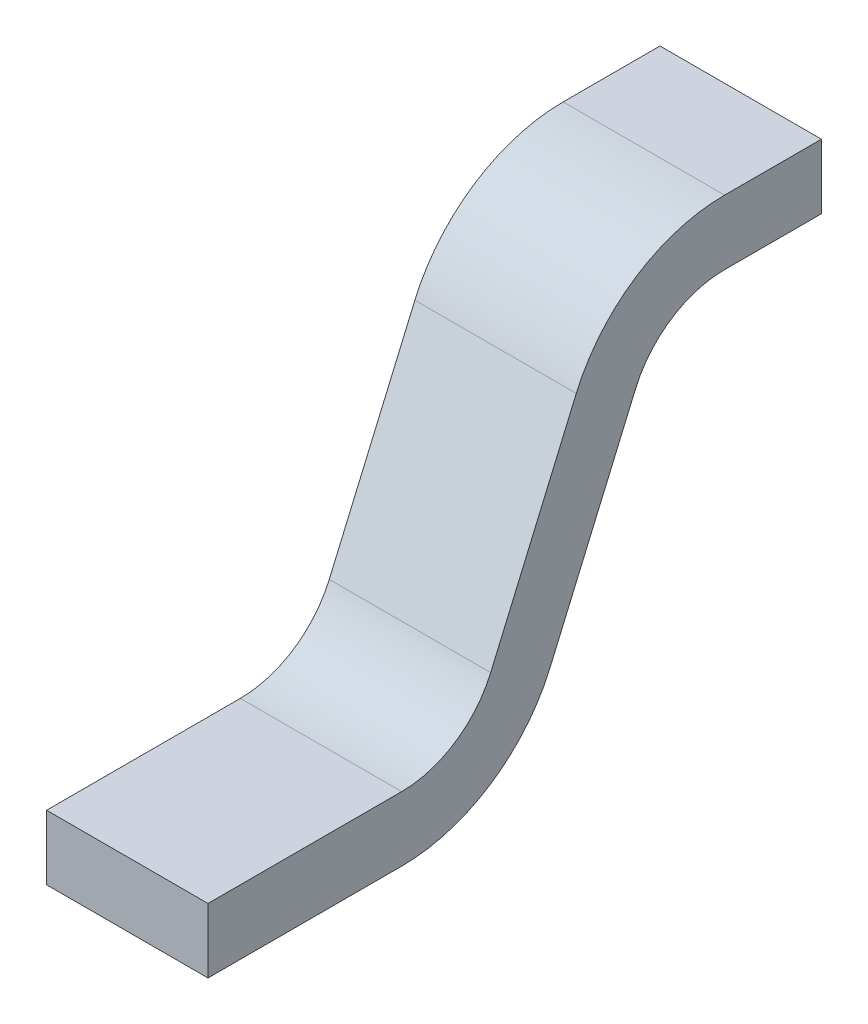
ISO-10303-21;
HEADER;
FILE_DESCRIPTION(('STEP AP214'),'2;1');
FILE_NAME('part.step','',(''),(''),'','','');
FILE_SCHEMA(('AUTOMOTIVE_DESIGN { 1 0 10303 214 1 1 1 1 }'));
ENDSEC;
DATA;
#1=APPLICATION_CONTEXT('core data for automotive mechanical design processes');
#2=APPLICATION_PROTOCOL_DEFINITION('international standard','automotive_design',2000,#1);
#3=PRODUCT_CONTEXT('',#1,'mechanical');
#4=PRODUCT('Part','Part','',(#3));
#5=PRODUCT_RELATED_PRODUCT_CATEGORY('part','',(#4));
#6=PRODUCT_DEFINITION_FORMATION('','',#4);
#7=PRODUCT_DEFINITION_CONTEXT('part definition',#1,'design');
#8=PRODUCT_DEFINITION('design','',#6,#7);
#9=PRODUCT_DEFINITION_SHAPE('','',#8);
#10=(LENGTH_UNIT() NAMED_UNIT(*) SI_UNIT(.MILLI.,.METRE.));
#11=(NAMED_UNIT(*) PLANE_ANGLE_UNIT() SI_UNIT($,.RADIAN.));
#12=(NAMED_UNIT(*) SI_UNIT($,.STERADIAN.) SOLID_ANGLE_UNIT());
#13=UNCERTAINTY_MEASURE_WITH_UNIT(LENGTH_MEASURE(1.E-05),#10,'distance_accuracy_value','');
#14=(GEOMETRIC_REPRESENTATION_CONTEXT(3) GLOBAL_UNCERTAINTY_ASSIGNED_CONTEXT((#13)) GLOBAL_UNIT_ASSIGNED_CONTEXT((#10,
#11,#12)) REPRESENTATION_CONTEXT('',''));
#15=CARTESIAN_POINT('',(0.,0.,0.));
#16=DIRECTION('',(0.,0.,1.));
#17=DIRECTION('',(1.,0.,0.));
#18=AXIS2_PLACEMENT_3D('',#15,#16,#17);
#19=CARTESIAN_POINT('',(0.125,-0.2,0.15));
#20=DIRECTION('',(1.,0.,0.));
#21=DIRECTION('',(0.,0.,-1.));
#22=AXIS2_PLACEMENT_3D('',#19,#20,#21);
#23=PLANE('',#22);
#24=DIRECTION('',(0.,0.918574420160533,-0.395248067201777));
#25=VECTOR('',#24,1.);
#26=CARTESIAN_POINT('',(0.125,-0.140712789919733,0.28778616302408));
#27=LINE('',#26,#25);
#28=CARTESIAN_POINT('',(0.125,-0.140712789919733,0.28778616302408));
#29=VERTEX_POINT('',#28);
#30=CARTESIAN_POINT('',(0.125,-0.448812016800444,0.420356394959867));
#31=VERTEX_POINT('',#30);
#32=EDGE_CURVE('E125',#29,#31,#27,.F.);
#33=ORIENTED_EDGE('',*,*,#32,.F.);
#34=CARTESIAN_POINT('',(0.125,-0.2,0.15));
#35=DIRECTION('',(1.,0.,0.));
#36=DIRECTION('',(0.,0.,-1.));
#37=AXIS2_PLACEMENT_3D('',#34,#35,#36);
#38=CIRCLE('',#37,0.15);
#39=CARTESIAN_POINT('',(0.125,-0.05,0.15));
#40=VERTEX_POINT('',#39);
#41=EDGE_CURVE('E111',#29,#40,#38,.F.);
#42=ORIENTED_EDGE('',*,*,#41,.T.);
#43=DIRECTION('',(0.,0.,-1.));
#44=VECTOR('',#43,1.);
#45=CARTESIAN_POINT('',(0.125,-0.05,0.15));
#46=LINE('',#45,#44);
#47=CARTESIAN_POINT('',(0.125,-0.05,0.));
#48=VERTEX_POINT('',#47);
#49=EDGE_CURVE('E109',#48,#40,#46,.F.);
#50=ORIENTED_EDGE('',*,*,#49,.F.);
#51=DIRECTION('',(0.,1.,0.));
#52=VECTOR('',#51,1.);
#53=CARTESIAN_POINT('',(0.125,0.05,0.));
#54=LINE('',#53,#52);
#55=CARTESIAN_POINT('',(0.125,0.05,0.));
#56=VERTEX_POINT('',#55);
#57=EDGE_CURVE('E94',#48,#56,#54,.T.);
#58=ORIENTED_EDGE('',*,*,#57,.T.);
#59=DIRECTION('',(0.,0.,-1.));
#60=VECTOR('',#59,1.);
#61=CARTESIAN_POINT('',(0.125,0.05,0.15));
#62=LINE('',#61,#60);
#63=CARTESIAN_POINT('',(0.125,0.05,0.15));
#64=VERTEX_POINT('',#63);
#65=EDGE_CURVE('E151',#56,#64,#62,.F.);
#66=ORIENTED_EDGE('',*,*,#65,.T.);
#67=CARTESIAN_POINT('',(0.125,-0.2,0.15));
#68=DIRECTION('',(1.,0.,0.));
#69=DIRECTION('',(0.,0.,-1.));
#70=AXIS2_PLACEMENT_3D('',#67,#68,#69);
#71=CIRCLE('',#70,0.25);
#72=CARTESIAN_POINT('',(0.125,-0.101187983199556,0.379643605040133));
#73=VERTEX_POINT('',#72);
#74=EDGE_CURVE('E20',#73,#64,#71,.F.);
#75=ORIENTED_EDGE('',*,*,#74,.F.);
#76=DIRECTION('',(0.,0.918574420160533,-0.395248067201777));
#77=VECTOR('',#76,1.);
#78=CARTESIAN_POINT('',(0.125,-0.101187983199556,0.379643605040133));
#79=LINE('',#78,#77);
#80=CARTESIAN_POINT('',(0.125,-0.409287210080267,0.51221383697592));
#81=VERTEX_POINT('',#80);
#82=EDGE_CURVE('E147',#73,#81,#79,.F.);
#83=ORIENTED_EDGE('',*,*,#82,.T.);
#84=CARTESIAN_POINT('',(0.125,-0.35,0.65));
#85=DIRECTION('',(1.,0.,0.));
#86=DIRECTION('',(0.,0.,-1.));
#87=AXIS2_PLACEMENT_3D('',#84,#85,#86);
#88=CIRCLE('',#87,0.15);
#89=CARTESIAN_POINT('',(0.125,-0.5,0.65));
#90=VERTEX_POINT('',#89);
#91=EDGE_CURVE('E174',#81,#90,#88,.F.);
#92=ORIENTED_EDGE('',*,*,#91,.T.);
#93=DIRECTION('',(0.,0.,-1.));
#94=VECTOR('',#93,1.);
#95=CARTESIAN_POINT('',(0.125,-0.5,0.95));
#96=LINE('',#95,#94);
#97=CARTESIAN_POINT('',(0.125,-0.5,0.95));
#98=VERTEX_POINT('',#97);
#99=EDGE_CURVE('E141',#90,#98,#96,.F.);
#100=ORIENTED_EDGE('',*,*,#99,.T.);
#101=DIRECTION('',(0.,1.,0.));
#102=VECTOR('',#101,1.);
#103=CARTESIAN_POINT('',(0.125,-0.6,0.95));
#104=LINE('',#103,#102);
#105=CARTESIAN_POINT('',(0.125,-0.6,0.95));
#106=VERTEX_POINT('',#105);
#107=EDGE_CURVE('E133',#98,#106,#104,.F.);
#108=ORIENTED_EDGE('',*,*,#107,.T.);
#109=DIRECTION('',(0.,0.,-1.));
#110=VECTOR('',#109,1.);
#111=CARTESIAN_POINT('',(0.125,-0.6,0.95));
#112=LINE('',#111,#110);
#113=CARTESIAN_POINT('',(0.125,-0.6,0.65));
#114=VERTEX_POINT('',#113);
#115=EDGE_CURVE('E129',#114,#106,#112,.F.);
#116=ORIENTED_EDGE('',*,*,#115,.F.);
#117=CARTESIAN_POINT('',(0.125,-0.35,0.65));
#118=DIRECTION('',(1.,0.,0.));
#119=DIRECTION('',(0.,0.,-1.));
#120=AXIS2_PLACEMENT_3D('',#117,#118,#119);
#121=CIRCLE('',#120,0.25);
#122=EDGE_CURVE('E173',#31,#114,#121,.F.);
#123=ORIENTED_EDGE('',*,*,#122,.F.);
#124=EDGE_LOOP('',(#33,#42,#50,#58,#66,#75,#83,#92,#100,#108,#116,#123));
#125=FACE_BOUND('',#124,.T.);
#126=ADVANCED_FACE('F17',(#125),#23,.T.);
#127=CARTESIAN_POINT('',(-0.125,0.05,0.));
#128=DIRECTION('',(0.,0.,1.));
#129=DIRECTION('',(1.,0.,0.));
#130=AXIS2_PLACEMENT_3D('',#127,#128,#129);
#131=PLANE('',#130);
#132=ORIENTED_EDGE('',*,*,#57,.F.);
#133=DIRECTION('',(1.,0.,0.));
#134=VECTOR('',#133,1.);
#135=CARTESIAN_POINT('',(-0.125,-0.05,0.));
#136=LINE('',#135,#134);
#137=CARTESIAN_POINT('',(-0.125,-0.05,0.));
#138=VERTEX_POINT('',#137);
#139=EDGE_CURVE('E104',#138,#48,#136,.T.);
#140=ORIENTED_EDGE('',*,*,#139,.F.);
#141=DIRECTION('',(0.,1.,0.));
#142=VECTOR('',#141,1.);
#143=CARTESIAN_POINT('',(-0.125,-0.2,0.));
#144=LINE('',#143,#142);
#145=CARTESIAN_POINT('',(-0.125,0.05,0.));
#146=VERTEX_POINT('',#145);
#147=EDGE_CURVE('E115',#138,#146,#144,.T.);
#148=ORIENTED_EDGE('',*,*,#147,.T.);
#149=DIRECTION('',(1.,0.,0.));
#150=VECTOR('',#149,1.);
#151=CARTESIAN_POINT('',(-0.125,0.05,0.));
#152=LINE('',#151,#150);
#153=EDGE_CURVE('E106',#146,#56,#152,.T.);
#154=ORIENTED_EDGE('',*,*,#153,.T.);
#155=EDGE_LOOP('',(#132,#140,#148,#154));
#156=FACE_BOUND('',#155,.T.);
#157=ADVANCED_FACE('F102',(#156),#131,.F.);
#158=CARTESIAN_POINT('',(-0.125,0.05,0.15));
#159=DIRECTION('',(0.,-1.,0.));
#160=DIRECTION('',(0.,0.,-1.));
#161=AXIS2_PLACEMENT_3D('',#158,#159,#160);
#162=PLANE('',#161);
#163=ORIENTED_EDGE('',*,*,#65,.F.);
#164=ORIENTED_EDGE('',*,*,#153,.F.);
#165=DIRECTION('',(0.,0.,-1.));
#166=VECTOR('',#165,1.);
#167=CARTESIAN_POINT('',(-0.125,0.05,0.15));
#168=LINE('',#167,#166);
#169=CARTESIAN_POINT('',(-0.125,0.05,0.15));
#170=VERTEX_POINT('',#169);
#171=EDGE_CURVE('E170',#146,#170,#168,.F.);
#172=ORIENTED_EDGE('',*,*,#171,.T.);
#173=DIRECTION('',(1.,0.,0.));
#174=VECTOR('',#173,1.);
#175=CARTESIAN_POINT('',(-0.125,0.05,0.15));
#176=LINE('',#175,#174);
#177=EDGE_CURVE('E186',#64,#170,#176,.F.);
#178=ORIENTED_EDGE('',*,*,#177,.F.);
#179=EDGE_LOOP('',(#163,#164,#172,#178));
#180=FACE_BOUND('',#179,.T.);
#181=ADVANCED_FACE('F199',(#180),#162,.F.);
#182=CARTESIAN_POINT('',(-0.125,-0.2,0.15));
#183=DIRECTION('',(1.,0.,0.));
#184=DIRECTION('',(0.,0.,-1.));
#185=AXIS2_PLACEMENT_3D('',#182,#183,#184);
#186=CYLINDRICAL_SURFACE('',#185,0.25);
#187=ORIENTED_EDGE('',*,*,#177,.T.);
#188=CARTESIAN_POINT('',(-0.125,-0.2,0.15));
#189=DIRECTION('',(1.,0.,0.));
#190=DIRECTION('',(0.,0.,-1.));
#191=AXIS2_PLACEMENT_3D('',#188,#189,#190);
#192=CIRCLE('',#191,0.25);
#193=CARTESIAN_POINT('',(-0.125,-0.101187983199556,0.379643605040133));
#194=VERTEX_POINT('',#193);
#195=EDGE_CURVE('E167',#170,#194,#192,.T.);
#196=ORIENTED_EDGE('',*,*,#195,.T.);
#197=DIRECTION('',(1.,0.,0.));
#198=VECTOR('',#197,1.);
#199=CARTESIAN_POINT('',(-0.125,-0.101187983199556,0.379643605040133));
#200=LINE('',#199,#198);
#201=EDGE_CURVE('E150',#194,#73,#200,.T.);
#202=ORIENTED_EDGE('',*,*,#201,.T.);
#203=ORIENTED_EDGE('',*,*,#74,.T.);
#204=EDGE_LOOP('',(#187,#196,#202,#203));
#205=FACE_BOUND('',#204,.T.);
#206=ADVANCED_FACE('F189',(#205),#186,.T.);
#207=CARTESIAN_POINT('',(-0.125,-0.101187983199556,0.379643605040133));
#208=DIRECTION('',(0.,-0.395248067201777,-0.918574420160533));
#209=DIRECTION('',(0.,0.918574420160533,-0.395248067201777));
#210=AXIS2_PLACEMENT_3D('',#207,#208,#209);
#211=PLANE('',#210);
#212=ORIENTED_EDGE('',*,*,#82,.F.);
#213=ORIENTED_EDGE('',*,*,#201,.F.);
#214=DIRECTION('',(0.,-0.918574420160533,0.395248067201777));
#215=VECTOR('',#214,1.);
#216=CARTESIAN_POINT('',(-0.125,-0.101187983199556,0.379643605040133));
#217=LINE('',#216,#215);
#218=CARTESIAN_POINT('',(-0.125,-0.409287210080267,0.51221383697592));
#219=VERTEX_POINT('',#218);
#220=EDGE_CURVE('E166',#194,#219,#217,.T.);
#221=ORIENTED_EDGE('',*,*,#220,.T.);
#222=DIRECTION('',(1.,0.,0.));
#223=VECTOR('',#222,1.);
#224=CARTESIAN_POINT('',(-0.125,-0.409287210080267,0.51221383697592));
#225=LINE('',#224,#223);
#226=EDGE_CURVE('E149',#219,#81,#225,.T.);
#227=ORIENTED_EDGE('',*,*,#226,.T.);
#228=EDGE_LOOP('',(#212,#213,#221,#227));
#229=FACE_BOUND('',#228,.T.);
#230=ADVANCED_FACE('F338',(#229),#211,.F.);
#231=CARTESIAN_POINT('',(-0.125,-0.35,0.65));
#232=DIRECTION('',(1.,0.,0.));
#233=DIRECTION('',(0.,0.,-1.));
#234=AXIS2_PLACEMENT_3D('',#231,#232,#233);
#235=CYLINDRICAL_SURFACE('',#234,0.15);
#236=ORIENTED_EDGE('',*,*,#91,.F.);
#237=ORIENTED_EDGE('',*,*,#226,.F.);
#238=CARTESIAN_POINT('',(-0.125,-0.35,0.65));
#239=DIRECTION('',(1.,0.,0.));
#240=DIRECTION('',(0.,0.,-1.));
#241=AXIS2_PLACEMENT_3D('',#238,#239,#240);
#242=CIRCLE('',#241,0.15);
#243=CARTESIAN_POINT('',(-0.125,-0.5,0.65));
#244=VERTEX_POINT('',#243);
#245=EDGE_CURVE('E162',#219,#244,#242,.F.);
#246=ORIENTED_EDGE('',*,*,#245,.T.);
#247=DIRECTION('',(1.,0.,0.));
#248=VECTOR('',#247,1.);
#249=CARTESIAN_POINT('',(-0.125,-0.5,0.65));
#250=LINE('',#249,#248);
#251=EDGE_CURVE('E144',#244,#90,#250,.T.);
#252=ORIENTED_EDGE('',*,*,#251,.T.);
#253=EDGE_LOOP('',(#236,#237,#246,#252));
#254=FACE_BOUND('',#253,.T.);
#255=ADVANCED_FACE('F329',(#254),#235,.F.);
#256=CARTESIAN_POINT('',(-0.125,-0.5,0.95));
#257=DIRECTION('',(0.,-1.,0.));
#258=DIRECTION('',(0.,0.,-1.));
#259=AXIS2_PLACEMENT_3D('',#256,#257,#258);
#260=PLANE('',#259);
#261=ORIENTED_EDGE('',*,*,#99,.F.);
#262=ORIENTED_EDGE('',*,*,#251,.F.);
#263=DIRECTION('',(0.,0.,-1.));
#264=VECTOR('',#263,1.);
#265=CARTESIAN_POINT('',(-0.125,-0.5,0.15));
#266=LINE('',#265,#264);
#267=CARTESIAN_POINT('',(-0.125,-0.5,0.95));
#268=VERTEX_POINT('',#267);
#269=EDGE_CURVE('E165',#244,#268,#266,.F.);
#270=ORIENTED_EDGE('',*,*,#269,.T.);
#271=DIRECTION('',(-1.,0.,0.));
#272=VECTOR('',#271,1.);
#273=CARTESIAN_POINT('',(-0.125,-0.5,0.95));
#274=LINE('',#273,#272);
#275=EDGE_CURVE('E138',#268,#98,#274,.F.);
#276=ORIENTED_EDGE('',*,*,#275,.T.);
#277=EDGE_LOOP('',(#261,#262,#270,#276));
#278=FACE_BOUND('',#277,.T.);
#279=ADVANCED_FACE('F229',(#278),#260,.F.);
#280=CARTESIAN_POINT('',(-0.125,-0.6,0.95));
#281=DIRECTION('',(0.,0.,-1.));
#282=DIRECTION('',(-1.,0.,0.));
#283=AXIS2_PLACEMENT_3D('',#280,#281,#282);
#284=PLANE('',#283);
#285=ORIENTED_EDGE('',*,*,#107,.F.);
#286=ORIENTED_EDGE('',*,*,#275,.F.);
#287=DIRECTION('',(0.,1.,0.));
#288=VECTOR('',#287,1.);
#289=CARTESIAN_POINT('',(-0.125,-0.2,0.95));
#290=LINE('',#289,#288);
#291=CARTESIAN_POINT('',(-0.125,-0.6,0.95));
#292=VERTEX_POINT('',#291);
#293=EDGE_CURVE('E219',#268,#292,#290,.F.);
#294=ORIENTED_EDGE('',*,*,#293,.T.);
#295=DIRECTION('',(1.,0.,0.));
#296=VECTOR('',#295,1.);
#297=CARTESIAN_POINT('',(-0.125,-0.6,0.95));
#298=LINE('',#297,#296);
#299=EDGE_CURVE('E132',#106,#292,#298,.F.);
#300=ORIENTED_EDGE('',*,*,#299,.F.);
#301=EDGE_LOOP('',(#285,#286,#294,#300));
#302=FACE_BOUND('',#301,.T.);
#303=ADVANCED_FACE('F234',(#302),#284,.F.);
#304=CARTESIAN_POINT('',(-0.125,-0.6,0.95));
#305=DIRECTION('',(0.,-1.,0.));
#306=DIRECTION('',(0.,0.,-1.));
#307=AXIS2_PLACEMENT_3D('',#304,#305,#306);
#308=PLANE('',#307);
#309=ORIENTED_EDGE('',*,*,#299,.T.);
#310=DIRECTION('',(0.,0.,-1.));
#311=VECTOR('',#310,1.);
#312=CARTESIAN_POINT('',(-0.125,-0.6,0.15));
#313=LINE('',#312,#311);
#314=CARTESIAN_POINT('',(-0.125,-0.6,0.65));
#315=VERTEX_POINT('',#314);
#316=EDGE_CURVE('E161',#292,#315,#313,.T.);
#317=ORIENTED_EDGE('',*,*,#316,.T.);
#318=DIRECTION('',(1.,0.,0.));
#319=VECTOR('',#318,1.);
#320=CARTESIAN_POINT('',(-0.125,-0.6,0.65));
#321=LINE('',#320,#319);
#322=EDGE_CURVE('E128',#114,#315,#321,.F.);
#323=ORIENTED_EDGE('',*,*,#322,.F.);
#324=ORIENTED_EDGE('',*,*,#115,.T.);
#325=EDGE_LOOP('',(#309,#317,#323,#324));
#326=FACE_BOUND('',#325,.T.);
#327=ADVANCED_FACE('F260',(#326),#308,.T.);
#328=CARTESIAN_POINT('',(-0.125,-0.35,0.65));
#329=DIRECTION('',(1.,0.,0.));
#330=DIRECTION('',(0.,0.,-1.));
#331=AXIS2_PLACEMENT_3D('',#328,#329,#330);
#332=CYLINDRICAL_SURFACE('',#331,0.25);
#333=ORIENTED_EDGE('',*,*,#322,.T.);
#334=CARTESIAN_POINT('',(-0.125,-0.35,0.65));
#335=DIRECTION('',(1.,0.,0.));
#336=DIRECTION('',(0.,0.,-1.));
#337=AXIS2_PLACEMENT_3D('',#334,#335,#336);
#338=CIRCLE('',#337,0.25);
#339=CARTESIAN_POINT('',(-0.125,-0.448812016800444,0.420356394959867));
#340=VERTEX_POINT('',#339);
#341=EDGE_CURVE('E158',#315,#340,#338,.T.);
#342=ORIENTED_EDGE('',*,*,#341,.T.);
#343=DIRECTION('',(1.,0.,0.));
#344=VECTOR('',#343,1.);
#345=CARTESIAN_POINT('',(-0.125,-0.448812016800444,0.420356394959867));
#346=LINE('',#345,#344);
#347=EDGE_CURVE('E127',#31,#340,#346,.F.);
#348=ORIENTED_EDGE('',*,*,#347,.F.);
#349=ORIENTED_EDGE('',*,*,#122,.T.);
#350=EDGE_LOOP('',(#333,#342,#348,#349));
#351=FACE_BOUND('',#350,.T.);
#352=ADVANCED_FACE('F257',(#351),#332,.T.);
#353=CARTESIAN_POINT('',(-0.125,-0.140712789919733,0.28778616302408));
#354=DIRECTION('',(0.,-0.395248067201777,-0.918574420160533));
#355=DIRECTION('',(0.,0.918574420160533,-0.395248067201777));
#356=AXIS2_PLACEMENT_3D('',#353,#354,#355);
#357=PLANE('',#356);
#358=ORIENTED_EDGE('',*,*,#347,.T.);
#359=DIRECTION('',(0.,0.918574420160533,-0.395248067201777));
#360=VECTOR('',#359,1.);
#361=CARTESIAN_POINT('',(-0.125,-0.448812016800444,0.420356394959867));
#362=LINE('',#361,#360);
#363=CARTESIAN_POINT('',(-0.125,-0.140712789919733,0.28778616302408));
#364=VERTEX_POINT('',#363);
#365=EDGE_CURVE('E157',#340,#364,#362,.T.);
#366=ORIENTED_EDGE('',*,*,#365,.T.);
#367=DIRECTION('',(1.,0.,0.));
#368=VECTOR('',#367,1.);
#369=CARTESIAN_POINT('',(-0.125,-0.140712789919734,0.28778616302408));
#370=LINE('',#369,#368);
#371=EDGE_CURVE('E172',#364,#29,#370,.T.);
#372=ORIENTED_EDGE('',*,*,#371,.T.);
#373=ORIENTED_EDGE('',*,*,#32,.T.);
#374=EDGE_LOOP('',(#358,#366,#372,#373));
#375=FACE_BOUND('',#374,.T.);
#376=ADVANCED_FACE('F254',(#375),#357,.T.);
#377=CARTESIAN_POINT('',(-0.125,-0.2,0.15));
#378=DIRECTION('',(1.,0.,0.));
#379=DIRECTION('',(0.,0.,-1.));
#380=AXIS2_PLACEMENT_3D('',#377,#378,#379);
#381=CYLINDRICAL_SURFACE('',#380,0.15);
#382=ORIENTED_EDGE('',*,*,#41,.F.);
#383=ORIENTED_EDGE('',*,*,#371,.F.);
#384=CARTESIAN_POINT('',(-0.125,-0.2,0.15));
#385=DIRECTION('',(1.,0.,0.));
#386=DIRECTION('',(0.,0.,-1.));
#387=AXIS2_PLACEMENT_3D('',#384,#385,#386);
#388=CIRCLE('',#387,0.15);
#389=CARTESIAN_POINT('',(-0.125,-0.05,0.15));
#390=VERTEX_POINT('',#389);
#391=EDGE_CURVE('E26',#364,#390,#388,.F.);
#392=ORIENTED_EDGE('',*,*,#391,.T.);
#393=DIRECTION('',(1.,0.,0.));
#394=VECTOR('',#393,1.);
#395=CARTESIAN_POINT('',(-0.125,-0.05,0.15));
#396=LINE('',#395,#394);
#397=EDGE_CURVE('E34',#40,#390,#396,.F.);
#398=ORIENTED_EDGE('',*,*,#397,.F.);
#399=EDGE_LOOP('',(#382,#383,#392,#398));
#400=FACE_BOUND('',#399,.T.);
#401=ADVANCED_FACE('F263',(#400),#381,.F.);
#402=CARTESIAN_POINT('',(-0.125,-0.05,0.15));
#403=DIRECTION('',(0.,-1.,0.));
#404=DIRECTION('',(0.,0.,-1.));
#405=AXIS2_PLACEMENT_3D('',#402,#403,#404);
#406=PLANE('',#405);
#407=ORIENTED_EDGE('',*,*,#397,.T.);
#408=DIRECTION('',(0.,0.,-1.));
#409=VECTOR('',#408,1.);
#410=CARTESIAN_POINT('',(-0.125,-0.05,0.15));
#411=LINE('',#410,#409);
#412=EDGE_CURVE('E10',#390,#138,#411,.T.);
#413=ORIENTED_EDGE('',*,*,#412,.T.);
#414=ORIENTED_EDGE('',*,*,#139,.T.);
#415=ORIENTED_EDGE('',*,*,#49,.T.);
#416=EDGE_LOOP('',(#407,#413,#414,#415));
#417=FACE_BOUND('',#416,.T.);
#418=ADVANCED_FACE('F108',(#417),#406,.T.);
#419=CARTESIAN_POINT('',(-0.125,-0.2,0.15));
#420=DIRECTION('',(1.,0.,0.));
#421=DIRECTION('',(0.,0.,-1.));
#422=AXIS2_PLACEMENT_3D('',#419,#420,#421);
#423=PLANE('',#422);
#424=ORIENTED_EDGE('',*,*,#391,.F.);
#425=ORIENTED_EDGE('',*,*,#365,.F.);
#426=ORIENTED_EDGE('',*,*,#341,.F.);
#427=ORIENTED_EDGE('',*,*,#316,.F.);
#428=ORIENTED_EDGE('',*,*,#293,.F.);
#429=ORIENTED_EDGE('',*,*,#269,.F.);
#430=ORIENTED_EDGE('',*,*,#245,.F.);
#431=ORIENTED_EDGE('',*,*,#220,.F.);
#432=ORIENTED_EDGE('',*,*,#195,.F.);
#433=ORIENTED_EDGE('',*,*,#171,.F.);
#434=ORIENTED_EDGE('',*,*,#147,.F.);
#435=ORIENTED_EDGE('',*,*,#412,.F.);
#436=EDGE_LOOP('',(#424,#425,#426,#427,#428,#429,#430,#431,#432,#433,#434,#435));
#437=FACE_BOUND('',#436,.T.);
#438=ADVANCED_FACE('F196',(#437),#423,.F.);
#439=CLOSED_SHELL('',(#126,#157,#181,#206,#230,#255,#279,#303,#327,#352,#376,#401,#418,#438));
#440=MANIFOLD_SOLID_BREP('B1',#439);
#441=ADVANCED_BREP_SHAPE_REPRESENTATION('',(#18,#440),#14);
#442=SHAPE_DEFINITION_REPRESENTATION(#9,#441);
ENDSEC;
END-ISO-10303-21;
